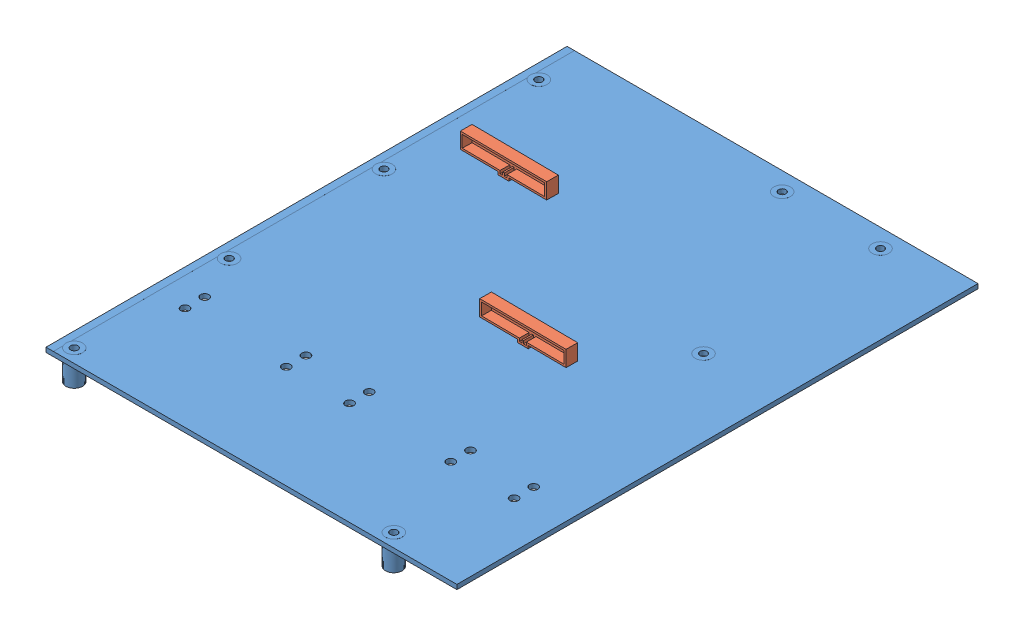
SolidWorks assembly FF_Board.SLDASM, configuration Default (file format 13000). Lengths in mm.
Overall size (212.3 24.77 269.24).
3 component instances, 2 part files, 0 mates.
Components (placement in the parent):
- FF_Board-1: FF_Board.SLDPRT [Default] at origin size (212.3 15.09 269.24)
- FF_3-36 Female Connector-2: FF_3-36 Female Connector.SLDPRT [Default] at (-50.2067 7.9622 145.3773) x (0.999962 0 0.008727) z (0.008727 0 -0.999962) size (45 9.7 6)
- FF_3-36 Female Connector-5: FF_3-36 Female Connector.SLDPRT [Default] at (-130.2067 7.9622 75.3773) x (0.999962 0 0.008727) z (0.008727 0 -0.999962) size (45 9.7 6)
